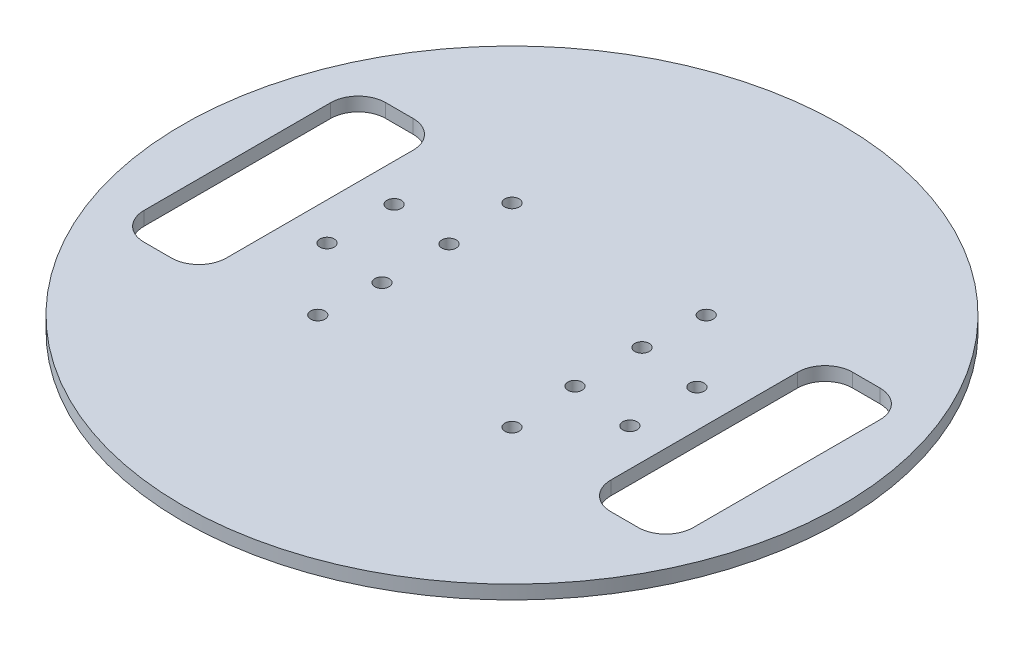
ISO-10303-21;
HEADER;
FILE_DESCRIPTION(('STEP AP214'),'2;1');
FILE_NAME('part.step','',(''),(''),'','','');
FILE_SCHEMA(('AUTOMOTIVE_DESIGN { 1 0 10303 214 1 1 1 1 }'));
ENDSEC;
DATA;
#1=APPLICATION_CONTEXT('core data for automotive mechanical design processes');
#2=APPLICATION_PROTOCOL_DEFINITION('international standard','automotive_design',2000,#1);
#3=PRODUCT_CONTEXT('',#1,'mechanical');
#4=PRODUCT('Part','Part','',(#3));
#5=PRODUCT_RELATED_PRODUCT_CATEGORY('part','',(#4));
#6=PRODUCT_DEFINITION_FORMATION('','',#4);
#7=PRODUCT_DEFINITION_CONTEXT('part definition',#1,'design');
#8=PRODUCT_DEFINITION('design','',#6,#7);
#9=PRODUCT_DEFINITION_SHAPE('','',#8);
#10=(LENGTH_UNIT() NAMED_UNIT(*) SI_UNIT(.MILLI.,.METRE.));
#11=(NAMED_UNIT(*) PLANE_ANGLE_UNIT() SI_UNIT($,.RADIAN.));
#12=(NAMED_UNIT(*) SI_UNIT($,.STERADIAN.) SOLID_ANGLE_UNIT());
#13=UNCERTAINTY_MEASURE_WITH_UNIT(LENGTH_MEASURE(1.E-05),#10,'distance_accuracy_value','');
#14=(GEOMETRIC_REPRESENTATION_CONTEXT(3) GLOBAL_UNCERTAINTY_ASSIGNED_CONTEXT((#13)) GLOBAL_UNIT_ASSIGNED_CONTEXT((#10,
#11,#12)) REPRESENTATION_CONTEXT('',''));
#15=CARTESIAN_POINT('',(0.,0.,0.));
#16=DIRECTION('',(0.,0.,1.));
#17=DIRECTION('',(1.,0.,0.));
#18=AXIS2_PLACEMENT_3D('',#15,#16,#17);
#19=CARTESIAN_POINT('',(-114.3,6.35,43.18));
#20=DIRECTION('',(0.,-1.,0.));
#21=DIRECTION('',(0.,0.,-1.));
#22=AXIS2_PLACEMENT_3D('',#19,#20,#21);
#23=CYLINDRICAL_SURFACE('',#22,12.7);
#24=CARTESIAN_POINT('',(-114.3,0.,43.18));
#25=DIRECTION('',(0.,1.,0.));
#26=DIRECTION('',(0.,0.,1.));
#27=AXIS2_PLACEMENT_3D('',#24,#25,#26);
#28=CIRCLE('',#27,12.7);
#29=CARTESIAN_POINT('',(-127.,0.,43.18));
#30=VERTEX_POINT('',#29);
#31=CARTESIAN_POINT('',(-114.3,0.,55.88));
#32=VERTEX_POINT('',#31);
#33=EDGE_CURVE('E233',#30,#32,#28,.T.);
#34=ORIENTED_EDGE('',*,*,#33,.F.);
#35=DIRECTION('',(0.,-1.,0.));
#36=VECTOR('',#35,1.);
#37=CARTESIAN_POINT('',(-127.,6.35,43.18));
#38=LINE('',#37,#36);
#39=CARTESIAN_POINT('',(-127.,6.35,43.18));
#40=VERTEX_POINT('',#39);
#41=EDGE_CURVE('E11',#40,#30,#38,.T.);
#42=ORIENTED_EDGE('',*,*,#41,.F.);
#43=CARTESIAN_POINT('',(-114.3,6.35,43.18));
#44=DIRECTION('',(0.,1.,0.));
#45=DIRECTION('',(0.,0.,1.));
#46=AXIS2_PLACEMENT_3D('',#43,#44,#45);
#47=CIRCLE('',#46,12.7);
#48=CARTESIAN_POINT('',(-114.3,6.35,55.88));
#49=VERTEX_POINT('',#48);
#50=EDGE_CURVE('E356',#40,#49,#47,.T.);
#51=ORIENTED_EDGE('',*,*,#50,.T.);
#52=DIRECTION('',(0.,-1.,0.));
#53=VECTOR('',#52,1.);
#54=CARTESIAN_POINT('',(-114.3,6.35,55.88));
#55=LINE('',#54,#53);
#56=EDGE_CURVE('E50',#49,#32,#55,.T.);
#57=ORIENTED_EDGE('',*,*,#56,.T.);
#58=EDGE_LOOP('',(#34,#42,#51,#57));
#59=FACE_BOUND('',#58,.T.);
#60=ADVANCED_FACE('F31',(#59),#23,.F.);
#61=CARTESIAN_POINT('',(-127.,6.35,0.));
#62=DIRECTION('',(1.,0.,0.));
#63=DIRECTION('',(0.,0.,-1.));
#64=AXIS2_PLACEMENT_3D('',#61,#62,#63);
#65=PLANE('',#64);
#66=DIRECTION('',(0.,0.,1.));
#67=VECTOR('',#66,1.);
#68=CARTESIAN_POINT('',(-127.,0.,0.));
#69=LINE('',#68,#67);
#70=CARTESIAN_POINT('',(-127.,0.,-43.18));
#71=VERTEX_POINT('',#70);
#72=EDGE_CURVE('E235',#71,#30,#69,.T.);
#73=ORIENTED_EDGE('',*,*,#72,.F.);
#74=DIRECTION('',(0.,-1.,0.));
#75=VECTOR('',#74,1.);
#76=CARTESIAN_POINT('',(-127.,6.35,-43.18));
#77=LINE('',#76,#75);
#78=CARTESIAN_POINT('',(-127.,6.35,-43.18));
#79=VERTEX_POINT('',#78);
#80=EDGE_CURVE('E41',#79,#71,#77,.T.);
#81=ORIENTED_EDGE('',*,*,#80,.F.);
#82=DIRECTION('',(0.,0.,1.));
#83=VECTOR('',#82,1.);
#84=CARTESIAN_POINT('',(-127.,6.35,0.));
#85=LINE('',#84,#83);
#86=EDGE_CURVE('E358',#79,#40,#85,.T.);
#87=ORIENTED_EDGE('',*,*,#86,.T.);
#88=ORIENTED_EDGE('',*,*,#41,.T.);
#89=EDGE_LOOP('',(#73,#81,#87,#88));
#90=FACE_BOUND('',#89,.T.);
#91=ADVANCED_FACE('F389',(#90),#65,.T.);
#92=CARTESIAN_POINT('',(-114.3,6.35,-43.18));
#93=DIRECTION('',(0.,-1.,0.));
#94=DIRECTION('',(0.,0.,-1.));
#95=AXIS2_PLACEMENT_3D('',#92,#93,#94);
#96=CYLINDRICAL_SURFACE('',#95,12.7);
#97=CARTESIAN_POINT('',(-114.3,0.,-43.18));
#98=DIRECTION('',(0.,1.,0.));
#99=DIRECTION('',(0.,0.,1.));
#100=AXIS2_PLACEMENT_3D('',#97,#98,#99);
#101=CIRCLE('',#100,12.7);
#102=CARTESIAN_POINT('',(-114.3,0.,-55.88));
#103=VERTEX_POINT('',#102);
#104=EDGE_CURVE('E238',#103,#71,#101,.T.);
#105=ORIENTED_EDGE('',*,*,#104,.F.);
#106=DIRECTION('',(0.,-1.,0.));
#107=VECTOR('',#106,1.);
#108=CARTESIAN_POINT('',(-114.3,6.35,-55.88));
#109=LINE('',#108,#107);
#110=CARTESIAN_POINT('',(-114.3,6.35,-55.88));
#111=VERTEX_POINT('',#110);
#112=EDGE_CURVE('E274',#111,#103,#109,.T.);
#113=ORIENTED_EDGE('',*,*,#112,.F.);
#114=CARTESIAN_POINT('',(-114.3,6.35,-43.18));
#115=DIRECTION('',(0.,1.,0.));
#116=DIRECTION('',(0.,0.,1.));
#117=AXIS2_PLACEMENT_3D('',#114,#115,#116);
#118=CIRCLE('',#117,12.7);
#119=EDGE_CURVE('E361',#111,#79,#118,.T.);
#120=ORIENTED_EDGE('',*,*,#119,.T.);
#121=ORIENTED_EDGE('',*,*,#80,.T.);
#122=EDGE_LOOP('',(#105,#113,#120,#121));
#123=FACE_BOUND('',#122,.T.);
#124=ADVANCED_FACE('F394',(#123),#96,.F.);
#125=CARTESIAN_POINT('',(-335.421421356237,6.35,-55.88));
#126=DIRECTION('',(0.,0.,1.));
#127=DIRECTION('',(1.,0.,0.));
#128=AXIS2_PLACEMENT_3D('',#125,#126,#127);
#129=PLANE('',#128);
#130=DIRECTION('',(-1.,0.,0.));
#131=VECTOR('',#130,1.);
#132=CARTESIAN_POINT('',(-335.421421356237,0.,-55.88));
#133=LINE('',#132,#131);
#134=CARTESIAN_POINT('',(-101.6,0.,-55.88));
#135=VERTEX_POINT('',#134);
#136=EDGE_CURVE('E241',#135,#103,#133,.T.);
#137=ORIENTED_EDGE('',*,*,#136,.F.);
#138=DIRECTION('',(0.,-1.,0.));
#139=VECTOR('',#138,1.);
#140=CARTESIAN_POINT('',(-101.6,6.35,-55.88));
#141=LINE('',#140,#139);
#142=CARTESIAN_POINT('',(-101.6,6.35,-55.88));
#143=VERTEX_POINT('',#142);
#144=EDGE_CURVE('E272',#143,#135,#141,.T.);
#145=ORIENTED_EDGE('',*,*,#144,.F.);
#146=DIRECTION('',(-1.,0.,0.));
#147=VECTOR('',#146,1.);
#148=CARTESIAN_POINT('',(-335.421421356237,6.35,-55.88));
#149=LINE('',#148,#147);
#150=EDGE_CURVE('E364',#143,#111,#149,.T.);
#151=ORIENTED_EDGE('',*,*,#150,.T.);
#152=ORIENTED_EDGE('',*,*,#112,.T.);
#153=EDGE_LOOP('',(#137,#145,#151,#152));
#154=FACE_BOUND('',#153,.T.);
#155=ADVANCED_FACE('F437',(#154),#129,.T.);
#156=CARTESIAN_POINT('',(-101.6,6.35,-43.18));
#157=DIRECTION('',(0.,-1.,0.));
#158=DIRECTION('',(0.,0.,-1.));
#159=AXIS2_PLACEMENT_3D('',#156,#157,#158);
#160=CYLINDRICAL_SURFACE('',#159,12.7);
#161=CARTESIAN_POINT('',(-101.6,0.,-43.18));
#162=DIRECTION('',(0.,1.,0.));
#163=DIRECTION('',(0.,0.,1.));
#164=AXIS2_PLACEMENT_3D('',#161,#162,#163);
#165=CIRCLE('',#164,12.7);
#166=CARTESIAN_POINT('',(-88.9,0.,-43.18));
#167=VERTEX_POINT('',#166);
#168=EDGE_CURVE('E244',#167,#135,#165,.T.);
#169=ORIENTED_EDGE('',*,*,#168,.F.);
#170=DIRECTION('',(0.,-1.,0.));
#171=VECTOR('',#170,1.);
#172=CARTESIAN_POINT('',(-88.9,6.35,-43.18));
#173=LINE('',#172,#171);
#174=CARTESIAN_POINT('',(-88.9,6.35,-43.18));
#175=VERTEX_POINT('',#174);
#176=EDGE_CURVE('E160',#175,#167,#173,.T.);
#177=ORIENTED_EDGE('',*,*,#176,.F.);
#178=CARTESIAN_POINT('',(-101.6,6.35,-43.18));
#179=DIRECTION('',(0.,1.,0.));
#180=DIRECTION('',(0.,0.,1.));
#181=AXIS2_PLACEMENT_3D('',#178,#179,#180);
#182=CIRCLE('',#181,12.7);
#183=EDGE_CURVE('E172',#175,#143,#182,.T.);
#184=ORIENTED_EDGE('',*,*,#183,.T.);
#185=ORIENTED_EDGE('',*,*,#144,.T.);
#186=EDGE_LOOP('',(#169,#177,#184,#185));
#187=FACE_BOUND('',#186,.T.);
#188=ADVANCED_FACE('F368',(#187),#160,.F.);
#189=CARTESIAN_POINT('',(-88.9,6.35,0.));
#190=DIRECTION('',(-1.,0.,0.));
#191=DIRECTION('',(0.,0.,1.));
#192=AXIS2_PLACEMENT_3D('',#189,#190,#191);
#193=PLANE('',#192);
#194=DIRECTION('',(0.,0.,-1.));
#195=VECTOR('',#194,1.);
#196=CARTESIAN_POINT('',(-88.9,0.,0.));
#197=LINE('',#196,#195);
#198=CARTESIAN_POINT('',(-88.9,0.,43.18));
#199=VERTEX_POINT('',#198);
#200=EDGE_CURVE('E156',#199,#167,#197,.T.);
#201=ORIENTED_EDGE('',*,*,#200,.F.);
#202=DIRECTION('',(0.,-1.,0.));
#203=VECTOR('',#202,1.);
#204=CARTESIAN_POINT('',(-88.9,6.35,43.18));
#205=LINE('',#204,#203);
#206=CARTESIAN_POINT('',(-88.9,6.35,43.18));
#207=VERTEX_POINT('',#206);
#208=EDGE_CURVE('E151',#207,#199,#205,.T.);
#209=ORIENTED_EDGE('',*,*,#208,.F.);
#210=DIRECTION('',(0.,0.,-1.));
#211=VECTOR('',#210,1.);
#212=CARTESIAN_POINT('',(-88.9,6.35,0.));
#213=LINE('',#212,#211);
#214=EDGE_CURVE('E154',#207,#175,#213,.T.);
#215=ORIENTED_EDGE('',*,*,#214,.T.);
#216=ORIENTED_EDGE('',*,*,#176,.T.);
#217=EDGE_LOOP('',(#201,#209,#215,#216));
#218=FACE_BOUND('',#217,.T.);
#219=ADVANCED_FACE('F153',(#218),#193,.T.);
#220=CARTESIAN_POINT('',(-101.6,6.35,43.18));
#221=DIRECTION('',(0.,-1.,0.));
#222=DIRECTION('',(0.,0.,-1.));
#223=AXIS2_PLACEMENT_3D('',#220,#221,#222);
#224=CYLINDRICAL_SURFACE('',#223,12.7);
#225=CARTESIAN_POINT('',(-101.6,0.,43.18));
#226=DIRECTION('',(0.,1.,0.));
#227=DIRECTION('',(0.,0.,1.));
#228=AXIS2_PLACEMENT_3D('',#225,#226,#227);
#229=CIRCLE('',#228,12.7);
#230=CARTESIAN_POINT('',(-101.6,0.,55.88));
#231=VERTEX_POINT('',#230);
#232=EDGE_CURVE('E248',#231,#199,#229,.T.);
#233=ORIENTED_EDGE('',*,*,#232,.F.);
#234=DIRECTION('',(0.,-1.,0.));
#235=VECTOR('',#234,1.);
#236=CARTESIAN_POINT('',(-101.6,6.35,55.88));
#237=LINE('',#236,#235);
#238=CARTESIAN_POINT('',(-101.6,6.35,55.88));
#239=VERTEX_POINT('',#238);
#240=EDGE_CURVE('E99',#239,#231,#237,.T.);
#241=ORIENTED_EDGE('',*,*,#240,.F.);
#242=CARTESIAN_POINT('',(-101.6,6.35,43.18));
#243=DIRECTION('',(0.,1.,0.));
#244=DIRECTION('',(0.,0.,1.));
#245=AXIS2_PLACEMENT_3D('',#242,#243,#244);
#246=CIRCLE('',#245,12.7);
#247=EDGE_CURVE('E169',#239,#207,#246,.T.);
#248=ORIENTED_EDGE('',*,*,#247,.T.);
#249=ORIENTED_EDGE('',*,*,#208,.T.);
#250=EDGE_LOOP('',(#233,#241,#248,#249));
#251=FACE_BOUND('',#250,.T.);
#252=ADVANCED_FACE('F174',(#251),#224,.F.);
#253=CARTESIAN_POINT('',(101.6,6.35,43.18));
#254=DIRECTION('',(0.,-1.,0.));
#255=DIRECTION('',(0.,0.,-1.));
#256=AXIS2_PLACEMENT_3D('',#253,#254,#255);
#257=CYLINDRICAL_SURFACE('',#256,12.7);
#258=CARTESIAN_POINT('',(101.6,0.,43.18));
#259=DIRECTION('',(0.,1.,0.));
#260=DIRECTION('',(0.,0.,1.));
#261=AXIS2_PLACEMENT_3D('',#258,#259,#260);
#262=CIRCLE('',#261,12.7);
#263=CARTESIAN_POINT('',(88.9,0.,43.18));
#264=VERTEX_POINT('',#263);
#265=CARTESIAN_POINT('',(101.6,0.,55.88));
#266=VERTEX_POINT('',#265);
#267=EDGE_CURVE('E196',#264,#266,#262,.T.);
#268=ORIENTED_EDGE('',*,*,#267,.F.);
#269=DIRECTION('',(0.,-1.,0.));
#270=VECTOR('',#269,1.);
#271=CARTESIAN_POINT('',(88.9,6.35,43.18));
#272=LINE('',#271,#270);
#273=CARTESIAN_POINT('',(88.9,6.35,43.18));
#274=VERTEX_POINT('',#273);
#275=EDGE_CURVE('E35',#274,#264,#272,.T.);
#276=ORIENTED_EDGE('',*,*,#275,.F.);
#277=CARTESIAN_POINT('',(101.6,6.35,43.18));
#278=DIRECTION('',(0.,1.,0.));
#279=DIRECTION('',(0.,0.,1.));
#280=AXIS2_PLACEMENT_3D('',#277,#278,#279);
#281=CIRCLE('',#280,12.7);
#282=CARTESIAN_POINT('',(101.6,6.35,55.88));
#283=VERTEX_POINT('',#282);
#284=EDGE_CURVE('E268',#274,#283,#281,.T.);
#285=ORIENTED_EDGE('',*,*,#284,.T.);
#286=DIRECTION('',(0.,-1.,0.));
#287=VECTOR('',#286,1.);
#288=CARTESIAN_POINT('',(101.6,6.35,55.88));
#289=LINE('',#288,#287);
#290=EDGE_CURVE('E195',#283,#266,#289,.T.);
#291=ORIENTED_EDGE('',*,*,#290,.T.);
#292=EDGE_LOOP('',(#268,#276,#285,#291));
#293=FACE_BOUND('',#292,.T.);
#294=ADVANCED_FACE('F33',(#293),#257,.F.);
#295=CARTESIAN_POINT('',(88.9,6.35,0.));
#296=DIRECTION('',(-1.,0.,0.));
#297=DIRECTION('',(0.,0.,1.));
#298=AXIS2_PLACEMENT_3D('',#295,#296,#297);
#299=PLANE('',#298);
#300=DIRECTION('',(0.,0.,-1.));
#301=VECTOR('',#300,1.);
#302=CARTESIAN_POINT('',(88.9,0.,0.));
#303=LINE('',#302,#301);
#304=CARTESIAN_POINT('',(88.9,0.,-43.18));
#305=VERTEX_POINT('',#304);
#306=EDGE_CURVE('E199',#264,#305,#303,.T.);
#307=ORIENTED_EDGE('',*,*,#306,.T.);
#308=DIRECTION('',(0.,-1.,0.));
#309=VECTOR('',#308,1.);
#310=CARTESIAN_POINT('',(88.9,6.35,-43.18));
#311=LINE('',#310,#309);
#312=CARTESIAN_POINT('',(88.9,6.35,-43.18));
#313=VERTEX_POINT('',#312);
#314=EDGE_CURVE('E287',#313,#305,#311,.T.);
#315=ORIENTED_EDGE('',*,*,#314,.F.);
#316=DIRECTION('',(0.,0.,-1.));
#317=VECTOR('',#316,1.);
#318=CARTESIAN_POINT('',(88.9,6.35,0.));
#319=LINE('',#318,#317);
#320=EDGE_CURVE('E295',#274,#313,#319,.T.);
#321=ORIENTED_EDGE('',*,*,#320,.F.);
#322=ORIENTED_EDGE('',*,*,#275,.T.);
#323=EDGE_LOOP('',(#307,#315,#321,#322));
#324=FACE_BOUND('',#323,.T.);
#325=ADVANCED_FACE('F294',(#324),#299,.F.);
#326=CARTESIAN_POINT('',(101.6,6.35,-43.18));
#327=DIRECTION('',(0.,-1.,0.));
#328=DIRECTION('',(0.,0.,-1.));
#329=AXIS2_PLACEMENT_3D('',#326,#327,#328);
#330=CYLINDRICAL_SURFACE('',#329,12.7);
#331=CARTESIAN_POINT('',(101.6,0.,-43.18));
#332=DIRECTION('',(0.,1.,0.));
#333=DIRECTION('',(0.,0.,1.));
#334=AXIS2_PLACEMENT_3D('',#331,#332,#333);
#335=CIRCLE('',#334,12.7);
#336=CARTESIAN_POINT('',(101.6,0.,-55.88));
#337=VERTEX_POINT('',#336);
#338=EDGE_CURVE('E203',#337,#305,#335,.T.);
#339=ORIENTED_EDGE('',*,*,#338,.F.);
#340=DIRECTION('',(0.,-1.,0.));
#341=VECTOR('',#340,1.);
#342=CARTESIAN_POINT('',(101.6,6.35,-55.88));
#343=LINE('',#342,#341);
#344=CARTESIAN_POINT('',(101.6,6.35,-55.88));
#345=VERTEX_POINT('',#344);
#346=EDGE_CURVE('E286',#345,#337,#343,.T.);
#347=ORIENTED_EDGE('',*,*,#346,.F.);
#348=CARTESIAN_POINT('',(101.6,6.35,-43.18));
#349=DIRECTION('',(0.,1.,0.));
#350=DIRECTION('',(0.,0.,1.));
#351=AXIS2_PLACEMENT_3D('',#348,#349,#350);
#352=CIRCLE('',#351,12.7);
#353=EDGE_CURVE('E329',#345,#313,#352,.T.);
#354=ORIENTED_EDGE('',*,*,#353,.T.);
#355=ORIENTED_EDGE('',*,*,#314,.T.);
#356=EDGE_LOOP('',(#339,#347,#354,#355));
#357=FACE_BOUND('',#356,.T.);
#358=ADVANCED_FACE('F327',(#357),#330,.F.);
#359=CARTESIAN_POINT('',(-335.421421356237,6.35,-55.88));
#360=DIRECTION('',(0.,0.,-1.));
#361=DIRECTION('',(-1.,0.,0.));
#362=AXIS2_PLACEMENT_3D('',#359,#360,#361);
#363=PLANE('',#362);
#364=DIRECTION('',(1.,0.,0.));
#365=VECTOR('',#364,1.);
#366=CARTESIAN_POINT('',(-335.421421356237,0.,-55.88));
#367=LINE('',#366,#365);
#368=CARTESIAN_POINT('',(114.3,0.,-55.88));
#369=VERTEX_POINT('',#368);
#370=EDGE_CURVE('E206',#337,#369,#367,.T.);
#371=ORIENTED_EDGE('',*,*,#370,.T.);
#372=DIRECTION('',(0.,-1.,0.));
#373=VECTOR('',#372,1.);
#374=CARTESIAN_POINT('',(114.3,6.35,-55.88));
#375=LINE('',#374,#373);
#376=CARTESIAN_POINT('',(114.3,6.35,-55.88));
#377=VERTEX_POINT('',#376);
#378=EDGE_CURVE('E284',#377,#369,#375,.T.);
#379=ORIENTED_EDGE('',*,*,#378,.F.);
#380=DIRECTION('',(1.,0.,0.));
#381=VECTOR('',#380,1.);
#382=CARTESIAN_POINT('',(-335.421421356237,6.35,-55.88));
#383=LINE('',#382,#381);
#384=EDGE_CURVE('E330',#345,#377,#383,.T.);
#385=ORIENTED_EDGE('',*,*,#384,.F.);
#386=ORIENTED_EDGE('',*,*,#346,.T.);
#387=EDGE_LOOP('',(#371,#379,#385,#386));
#388=FACE_BOUND('',#387,.T.);
#389=ADVANCED_FACE('F326',(#388),#363,.F.);
#390=CARTESIAN_POINT('',(114.3,6.35,-43.18));
#391=DIRECTION('',(0.,-1.,0.));
#392=DIRECTION('',(0.,0.,-1.));
#393=AXIS2_PLACEMENT_3D('',#390,#391,#392);
#394=CYLINDRICAL_SURFACE('',#393,12.7);
#395=CARTESIAN_POINT('',(114.3,0.,-43.18));
#396=DIRECTION('',(0.,1.,0.));
#397=DIRECTION('',(0.,0.,1.));
#398=AXIS2_PLACEMENT_3D('',#395,#396,#397);
#399=CIRCLE('',#398,12.7);
#400=CARTESIAN_POINT('',(127.,0.,-43.18));
#401=VERTEX_POINT('',#400);
#402=EDGE_CURVE('E209',#401,#369,#399,.T.);
#403=ORIENTED_EDGE('',*,*,#402,.F.);
#404=DIRECTION('',(0.,-1.,0.));
#405=VECTOR('',#404,1.);
#406=CARTESIAN_POINT('',(127.,6.35,-43.18));
#407=LINE('',#406,#405);
#408=CARTESIAN_POINT('',(127.,6.35,-43.18));
#409=VERTEX_POINT('',#408);
#410=EDGE_CURVE('E282',#409,#401,#407,.T.);
#411=ORIENTED_EDGE('',*,*,#410,.F.);
#412=CARTESIAN_POINT('',(114.3,6.35,-43.18));
#413=DIRECTION('',(0.,1.,0.));
#414=DIRECTION('',(0.,0.,1.));
#415=AXIS2_PLACEMENT_3D('',#412,#413,#414);
#416=CIRCLE('',#415,12.7);
#417=EDGE_CURVE('E323',#409,#377,#416,.T.);
#418=ORIENTED_EDGE('',*,*,#417,.T.);
#419=ORIENTED_EDGE('',*,*,#378,.T.);
#420=EDGE_LOOP('',(#403,#411,#418,#419));
#421=FACE_BOUND('',#420,.T.);
#422=ADVANCED_FACE('F319',(#421),#394,.F.);
#423=CARTESIAN_POINT('',(127.,6.35,0.));
#424=DIRECTION('',(1.,0.,0.));
#425=DIRECTION('',(0.,0.,-1.));
#426=AXIS2_PLACEMENT_3D('',#423,#424,#425);
#427=PLANE('',#426);
#428=DIRECTION('',(0.,0.,1.));
#429=VECTOR('',#428,1.);
#430=CARTESIAN_POINT('',(127.,0.,0.));
#431=LINE('',#430,#429);
#432=CARTESIAN_POINT('',(127.,0.,43.18));
#433=VERTEX_POINT('',#432);
#434=EDGE_CURVE('E212',#401,#433,#431,.T.);
#435=ORIENTED_EDGE('',*,*,#434,.T.);
#436=DIRECTION('',(0.,-1.,0.));
#437=VECTOR('',#436,1.);
#438=CARTESIAN_POINT('',(127.,6.35,43.18));
#439=LINE('',#438,#437);
#440=CARTESIAN_POINT('',(127.,6.35,43.18));
#441=VERTEX_POINT('',#440);
#442=EDGE_CURVE('E280',#441,#433,#439,.T.);
#443=ORIENTED_EDGE('',*,*,#442,.F.);
#444=DIRECTION('',(0.,0.,1.));
#445=VECTOR('',#444,1.);
#446=CARTESIAN_POINT('',(127.,6.35,0.));
#447=LINE('',#446,#445);
#448=EDGE_CURVE('E339',#409,#441,#447,.T.);
#449=ORIENTED_EDGE('',*,*,#448,.F.);
#450=ORIENTED_EDGE('',*,*,#410,.T.);
#451=EDGE_LOOP('',(#435,#443,#449,#450));
#452=FACE_BOUND('',#451,.T.);
#453=ADVANCED_FACE('F316',(#452),#427,.F.);
#454=CARTESIAN_POINT('',(114.3,6.35,43.18));
#455=DIRECTION('',(0.,-1.,0.));
#456=DIRECTION('',(0.,0.,-1.));
#457=AXIS2_PLACEMENT_3D('',#454,#455,#456);
#458=CYLINDRICAL_SURFACE('',#457,12.7);
#459=CARTESIAN_POINT('',(114.3,0.,43.18));
#460=DIRECTION('',(0.,1.,0.));
#461=DIRECTION('',(0.,0.,1.));
#462=AXIS2_PLACEMENT_3D('',#459,#460,#461);
#463=CIRCLE('',#462,12.7);
#464=CARTESIAN_POINT('',(114.3,0.,55.88));
#465=VERTEX_POINT('',#464);
#466=EDGE_CURVE('E215',#465,#433,#463,.T.);
#467=ORIENTED_EDGE('',*,*,#466,.F.);
#468=DIRECTION('',(0.,-1.,0.));
#469=VECTOR('',#468,1.);
#470=CARTESIAN_POINT('',(114.3,6.35,55.88));
#471=LINE('',#470,#469);
#472=CARTESIAN_POINT('',(114.3,6.35,55.88));
#473=VERTEX_POINT('',#472);
#474=EDGE_CURVE('E278',#473,#465,#471,.T.);
#475=ORIENTED_EDGE('',*,*,#474,.F.);
#476=CARTESIAN_POINT('',(114.3,6.35,43.18));
#477=DIRECTION('',(0.,1.,0.));
#478=DIRECTION('',(0.,0.,1.));
#479=AXIS2_PLACEMENT_3D('',#476,#477,#478);
#480=CIRCLE('',#479,12.7);
#481=EDGE_CURVE('E313',#473,#441,#480,.T.);
#482=ORIENTED_EDGE('',*,*,#481,.T.);
#483=ORIENTED_EDGE('',*,*,#442,.T.);
#484=EDGE_LOOP('',(#467,#475,#482,#483));
#485=FACE_BOUND('',#484,.T.);
#486=ADVANCED_FACE('F309',(#485),#458,.F.);
#487=CARTESIAN_POINT('',(-43.03131856,6.35,-13.91245376));
#488=DIRECTION('',(0.,-1.,0.));
#489=DIRECTION('',(0.,0.,-1.));
#490=AXIS2_PLACEMENT_3D('',#487,#488,#489);
#491=CYLINDRICAL_SURFACE('',#490,3.302);
#492=CARTESIAN_POINT('',(-43.03131856,6.35,-13.91245376));
#493=DIRECTION('',(0.,1.,0.));
#494=DIRECTION('',(0.,0.,1.));
#495=AXIS2_PLACEMENT_3D('',#492,#493,#494);
#496=CIRCLE('',#495,3.302);
#497=CARTESIAN_POINT('',(-43.03131856,6.35,-10.61045376));
#498=VERTEX_POINT('',#497);
#499=EDGE_CURVE('E189',#498,#498,#496,.T.);
#500=ORIENTED_EDGE('',*,*,#499,.T.);
#501=EDGE_LOOP('',(#500));
#502=FACE_BOUND('',#501,.T.);
#503=CARTESIAN_POINT('',(-43.03131856,0.,-13.91245376));
#504=DIRECTION('',(0.,1.,0.));
#505=DIRECTION('',(0.,0.,1.));
#506=AXIS2_PLACEMENT_3D('',#503,#504,#505);
#507=CIRCLE('',#506,3.302);
#508=CARTESIAN_POINT('',(-43.03131856,0.,-10.61045376));
#509=VERTEX_POINT('',#508);
#510=EDGE_CURVE('E262',#509,#509,#507,.T.);
#511=ORIENTED_EDGE('',*,*,#510,.F.);
#512=EDGE_LOOP('',(#511));
#513=FACE_BOUND('',#512,.T.);
#514=ADVANCED_FACE('F415',(#502,#513),#491,.F.);
#515=CARTESIAN_POINT('',(-43.03131856,6.35,17.08745376));
#516=DIRECTION('',(0.,-1.,0.));
#517=DIRECTION('',(0.,0.,-1.));
#518=AXIS2_PLACEMENT_3D('',#515,#516,#517);
#519=CYLINDRICAL_SURFACE('',#518,3.302);
#520=CARTESIAN_POINT('',(-43.03131856,6.35,17.08745376));
#521=DIRECTION('',(0.,1.,0.));
#522=DIRECTION('',(0.,0.,1.));
#523=AXIS2_PLACEMENT_3D('',#520,#521,#522);
#524=CIRCLE('',#523,3.302);
#525=CARTESIAN_POINT('',(-43.03131856,6.35,20.38945376));
#526=VERTEX_POINT('',#525);
#527=EDGE_CURVE('E186',#526,#526,#524,.T.);
#528=ORIENTED_EDGE('',*,*,#527,.T.);
#529=EDGE_LOOP('',(#528));
#530=FACE_BOUND('',#529,.T.);
#531=CARTESIAN_POINT('',(-43.03131856,0.,17.08745376));
#532=DIRECTION('',(0.,1.,0.));
#533=DIRECTION('',(0.,0.,1.));
#534=AXIS2_PLACEMENT_3D('',#531,#532,#533);
#535=CIRCLE('',#534,3.302);
#536=CARTESIAN_POINT('',(-43.03131856,0.,20.38945376));
#537=VERTEX_POINT('',#536);
#538=EDGE_CURVE('E259',#537,#537,#535,.T.);
#539=ORIENTED_EDGE('',*,*,#538,.F.);
#540=EDGE_LOOP('',(#539));
#541=FACE_BOUND('',#540,.T.);
#542=ADVANCED_FACE('F513',(#530,#541),#519,.F.);
#543=CARTESIAN_POINT('',(-71.60631856,6.35,-17.08745376));
#544=DIRECTION('',(0.,-1.,0.));
#545=DIRECTION('',(0.,0.,-1.));
#546=AXIS2_PLACEMENT_3D('',#543,#544,#545);
#547=CYLINDRICAL_SURFACE('',#546,3.302);
#548=CARTESIAN_POINT('',(-71.60631856,6.35,-17.08745376));
#549=DIRECTION('',(0.,1.,0.));
#550=DIRECTION('',(0.,0.,1.));
#551=AXIS2_PLACEMENT_3D('',#548,#549,#550);
#552=CIRCLE('',#551,3.302);
#553=CARTESIAN_POINT('',(-71.60631856,6.35,-13.78545376));
#554=VERTEX_POINT('',#553);
#555=EDGE_CURVE('E183',#554,#554,#552,.T.);
#556=ORIENTED_EDGE('',*,*,#555,.T.);
#557=EDGE_LOOP('',(#556));
#558=FACE_BOUND('',#557,.T.);
#559=CARTESIAN_POINT('',(-71.60631856,0.,-17.08745376));
#560=DIRECTION('',(0.,1.,0.));
#561=DIRECTION('',(0.,0.,1.));
#562=AXIS2_PLACEMENT_3D('',#559,#560,#561);
#563=CIRCLE('',#562,3.302);
#564=CARTESIAN_POINT('',(-71.60631856,0.,-13.78545376));
#565=VERTEX_POINT('',#564);
#566=EDGE_CURVE('E256',#565,#565,#563,.T.);
#567=ORIENTED_EDGE('',*,*,#566,.F.);
#568=EDGE_LOOP('',(#567));
#569=FACE_BOUND('',#568,.T.);
#570=ADVANCED_FACE('F384',(#558,#569),#547,.F.);
#571=CARTESIAN_POINT('',(-71.60631856,6.35,13.91245376));
#572=DIRECTION('',(0.,-1.,0.));
#573=DIRECTION('',(0.,0.,-1.));
#574=AXIS2_PLACEMENT_3D('',#571,#572,#573);
#575=CYLINDRICAL_SURFACE('',#574,3.302);
#576=CARTESIAN_POINT('',(-71.60631856,6.35,13.91245376));
#577=DIRECTION('',(0.,1.,0.));
#578=DIRECTION('',(0.,0.,1.));
#579=AXIS2_PLACEMENT_3D('',#576,#577,#578);
#580=CIRCLE('',#579,3.302);
#581=CARTESIAN_POINT('',(-71.60631856,6.35,17.21445376));
#582=VERTEX_POINT('',#581);
#583=EDGE_CURVE('E177',#582,#582,#580,.T.);
#584=ORIENTED_EDGE('',*,*,#583,.T.);
#585=EDGE_LOOP('',(#584));
#586=FACE_BOUND('',#585,.T.);
#587=CARTESIAN_POINT('',(-71.60631856,0.,13.91245376));
#588=DIRECTION('',(0.,1.,0.));
#589=DIRECTION('',(0.,0.,1.));
#590=AXIS2_PLACEMENT_3D('',#587,#588,#589);
#591=CIRCLE('',#590,3.302);
#592=CARTESIAN_POINT('',(-71.60631856,0.,17.21445376));
#593=VERTEX_POINT('',#592);
#594=EDGE_CURVE('E253',#593,#593,#591,.T.);
#595=ORIENTED_EDGE('',*,*,#594,.F.);
#596=EDGE_LOOP('',(#595));
#597=FACE_BOUND('',#596,.T.);
#598=ADVANCED_FACE('F375',(#586,#597),#575,.F.);
#599=CARTESIAN_POINT('',(-335.421421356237,6.35,55.88));
#600=DIRECTION('',(0.,0.,-1.));
#601=DIRECTION('',(-1.,0.,0.));
#602=AXIS2_PLACEMENT_3D('',#599,#600,#601);
#603=PLANE('',#602);
#604=DIRECTION('',(1.,0.,0.));
#605=VECTOR('',#604,1.);
#606=CARTESIAN_POINT('',(-335.421421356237,0.,55.88));
#607=LINE('',#606,#605);
#608=EDGE_CURVE('E250',#32,#231,#607,.T.);
#609=ORIENTED_EDGE('',*,*,#608,.F.);
#610=ORIENTED_EDGE('',*,*,#56,.F.);
#611=DIRECTION('',(1.,0.,0.));
#612=VECTOR('',#611,1.);
#613=CARTESIAN_POINT('',(-335.421421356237,6.35,55.88));
#614=LINE('',#613,#612);
#615=EDGE_CURVE('E175',#49,#239,#614,.T.);
#616=ORIENTED_EDGE('',*,*,#615,.T.);
#617=ORIENTED_EDGE('',*,*,#240,.T.);
#618=EDGE_LOOP('',(#609,#610,#616,#617));
#619=FACE_BOUND('',#618,.T.);
#620=ADVANCED_FACE('F372',(#619),#603,.T.);
#621=CARTESIAN_POINT('',(43.03131856,6.35,13.91245376));
#622=DIRECTION('',(0.,-1.,0.));
#623=DIRECTION('',(0.,0.,-1.));
#624=AXIS2_PLACEMENT_3D('',#621,#622,#623);
#625=CYLINDRICAL_SURFACE('',#624,3.302);
#626=CARTESIAN_POINT('',(43.03131856,6.35,13.91245376));
#627=DIRECTION('',(0.,1.,0.));
#628=DIRECTION('',(0.,0.,1.));
#629=AXIS2_PLACEMENT_3D('',#626,#627,#628);
#630=CIRCLE('',#629,3.302);
#631=CARTESIAN_POINT('',(43.03131856,6.35,17.21445376));
#632=VERTEX_POINT('',#631);
#633=EDGE_CURVE('E353',#632,#632,#630,.T.);
#634=ORIENTED_EDGE('',*,*,#633,.T.);
#635=EDGE_LOOP('',(#634));
#636=FACE_BOUND('',#635,.T.);
#637=CARTESIAN_POINT('',(43.03131856,0.,13.91245376));
#638=DIRECTION('',(0.,1.,0.));
#639=DIRECTION('',(0.,0.,1.));
#640=AXIS2_PLACEMENT_3D('',#637,#638,#639);
#641=CIRCLE('',#640,3.302);
#642=CARTESIAN_POINT('',(43.03131856,0.,17.21445376));
#643=VERTEX_POINT('',#642);
#644=EDGE_CURVE('E230',#643,#643,#641,.T.);
#645=ORIENTED_EDGE('',*,*,#644,.F.);
#646=EDGE_LOOP('',(#645));
#647=FACE_BOUND('',#646,.T.);
#648=ADVANCED_FACE('F374',(#636,#647),#625,.F.);
#649=CARTESIAN_POINT('',(43.03131856,6.35,-17.08745376));
#650=DIRECTION('',(0.,-1.,0.));
#651=DIRECTION('',(0.,0.,-1.));
#652=AXIS2_PLACEMENT_3D('',#649,#650,#651);
#653=CYLINDRICAL_SURFACE('',#652,3.302);
#654=CARTESIAN_POINT('',(43.03131856,6.35,-17.08745376));
#655=DIRECTION('',(0.,1.,0.));
#656=DIRECTION('',(0.,0.,1.));
#657=AXIS2_PLACEMENT_3D('',#654,#655,#656);
#658=CIRCLE('',#657,3.302);
#659=CARTESIAN_POINT('',(43.03131856,6.35,-13.78545376));
#660=VERTEX_POINT('',#659);
#661=EDGE_CURVE('E350',#660,#660,#658,.T.);
#662=ORIENTED_EDGE('',*,*,#661,.T.);
#663=EDGE_LOOP('',(#662));
#664=FACE_BOUND('',#663,.T.);
#665=CARTESIAN_POINT('',(43.03131856,0.,-17.08745376));
#666=DIRECTION('',(0.,1.,0.));
#667=DIRECTION('',(0.,0.,1.));
#668=AXIS2_PLACEMENT_3D('',#665,#666,#667);
#669=CIRCLE('',#668,3.302);
#670=CARTESIAN_POINT('',(43.03131856,0.,-13.78545376));
#671=VERTEX_POINT('',#670);
#672=EDGE_CURVE('E227',#671,#671,#669,.T.);
#673=ORIENTED_EDGE('',*,*,#672,.F.);
#674=EDGE_LOOP('',(#673));
#675=FACE_BOUND('',#674,.T.);
#676=ADVANCED_FACE('F381',(#664,#675),#653,.F.);
#677=CARTESIAN_POINT('',(71.60631856,6.35,17.08745376));
#678=DIRECTION('',(0.,-1.,0.));
#679=DIRECTION('',(0.,0.,-1.));
#680=AXIS2_PLACEMENT_3D('',#677,#678,#679);
#681=CYLINDRICAL_SURFACE('',#680,3.302);
#682=CARTESIAN_POINT('',(71.60631856,6.35,17.08745376));
#683=DIRECTION('',(0.,1.,0.));
#684=DIRECTION('',(0.,0.,1.));
#685=AXIS2_PLACEMENT_3D('',#682,#683,#684);
#686=CIRCLE('',#685,3.302);
#687=CARTESIAN_POINT('',(71.60631856,6.35,20.38945376));
#688=VERTEX_POINT('',#687);
#689=EDGE_CURVE('E347',#688,#688,#686,.T.);
#690=ORIENTED_EDGE('',*,*,#689,.T.);
#691=EDGE_LOOP('',(#690));
#692=FACE_BOUND('',#691,.T.);
#693=CARTESIAN_POINT('',(71.60631856,0.,17.08745376));
#694=DIRECTION('',(0.,1.,0.));
#695=DIRECTION('',(0.,0.,1.));
#696=AXIS2_PLACEMENT_3D('',#693,#694,#695);
#697=CIRCLE('',#696,3.302);
#698=CARTESIAN_POINT('',(71.60631856,0.,20.38945376));
#699=VERTEX_POINT('',#698);
#700=EDGE_CURVE('E224',#699,#699,#697,.T.);
#701=ORIENTED_EDGE('',*,*,#700,.F.);
#702=EDGE_LOOP('',(#701));
#703=FACE_BOUND('',#702,.T.);
#704=ADVANCED_FACE('F401',(#692,#703),#681,.F.);
#705=CARTESIAN_POINT('',(71.60631856,6.35,-13.91245376));
#706=DIRECTION('',(0.,-1.,0.));
#707=DIRECTION('',(0.,0.,-1.));
#708=AXIS2_PLACEMENT_3D('',#705,#706,#707);
#709=CYLINDRICAL_SURFACE('',#708,3.302);
#710=CARTESIAN_POINT('',(71.60631856,6.35,-13.91245376));
#711=DIRECTION('',(0.,1.,0.));
#712=DIRECTION('',(0.,0.,1.));
#713=AXIS2_PLACEMENT_3D('',#710,#711,#712);
#714=CIRCLE('',#713,3.302);
#715=CARTESIAN_POINT('',(71.60631856,6.35,-10.61045376));
#716=VERTEX_POINT('',#715);
#717=EDGE_CURVE('E344',#716,#716,#714,.T.);
#718=ORIENTED_EDGE('',*,*,#717,.T.);
#719=EDGE_LOOP('',(#718));
#720=FACE_BOUND('',#719,.T.);
#721=CARTESIAN_POINT('',(71.60631856,0.,-13.91245376));
#722=DIRECTION('',(0.,1.,0.));
#723=DIRECTION('',(0.,0.,1.));
#724=AXIS2_PLACEMENT_3D('',#721,#722,#723);
#725=CIRCLE('',#724,3.302);
#726=CARTESIAN_POINT('',(71.60631856,0.,-10.61045376));
#727=VERTEX_POINT('',#726);
#728=EDGE_CURVE('E221',#727,#727,#725,.T.);
#729=ORIENTED_EDGE('',*,*,#728,.F.);
#730=EDGE_LOOP('',(#729));
#731=FACE_BOUND('',#730,.T.);
#732=ADVANCED_FACE('F405',(#720,#731),#709,.F.);
#733=CARTESIAN_POINT('',(-335.421421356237,6.35,55.88));
#734=DIRECTION('',(0.,0.,1.));
#735=DIRECTION('',(1.,0.,0.));
#736=AXIS2_PLACEMENT_3D('',#733,#734,#735);
#737=PLANE('',#736);
#738=DIRECTION('',(-1.,0.,0.));
#739=VECTOR('',#738,1.);
#740=CARTESIAN_POINT('',(-335.421421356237,0.,55.88));
#741=LINE('',#740,#739);
#742=EDGE_CURVE('E218',#465,#266,#741,.T.);
#743=ORIENTED_EDGE('',*,*,#742,.T.);
#744=ORIENTED_EDGE('',*,*,#290,.F.);
#745=DIRECTION('',(-1.,0.,0.));
#746=VECTOR('',#745,1.);
#747=CARTESIAN_POINT('',(-335.421421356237,6.35,55.88));
#748=LINE('',#747,#746);
#749=EDGE_CURVE('E342',#473,#283,#748,.T.);
#750=ORIENTED_EDGE('',*,*,#749,.F.);
#751=ORIENTED_EDGE('',*,*,#474,.T.);
#752=EDGE_LOOP('',(#743,#744,#750,#751));
#753=FACE_BOUND('',#752,.T.);
#754=ADVANCED_FACE('F305',(#753),#737,.F.);
#755=CARTESIAN_POINT('',(0.,6.35,0.));
#756=DIRECTION('',(0.,-1.,0.));
#757=DIRECTION('',(0.,0.,-1.));
#758=AXIS2_PLACEMENT_3D('',#755,#756,#757);
#759=CYLINDRICAL_SURFACE('',#758,152.4);
#760=CARTESIAN_POINT('',(0.,6.35,0.));
#761=DIRECTION('',(0.,1.,0.));
#762=DIRECTION('',(0.,0.,1.));
#763=AXIS2_PLACEMENT_3D('',#760,#761,#762);
#764=CIRCLE('',#763,152.4);
#765=CARTESIAN_POINT('',(0.,6.35,152.4));
#766=VERTEX_POINT('',#765);
#767=EDGE_CURVE('E192',#766,#766,#764,.T.);
#768=ORIENTED_EDGE('',*,*,#767,.F.);
#769=EDGE_LOOP('',(#768));
#770=FACE_BOUND('',#769,.T.);
#771=CARTESIAN_POINT('',(0.,0.,0.));
#772=DIRECTION('',(0.,1.,0.));
#773=DIRECTION('',(0.,0.,1.));
#774=AXIS2_PLACEMENT_3D('',#771,#772,#773);
#775=CIRCLE('',#774,152.4);
#776=CARTESIAN_POINT('',(0.,0.,152.4));
#777=VERTEX_POINT('',#776);
#778=EDGE_CURVE('E265',#777,#777,#775,.T.);
#779=ORIENTED_EDGE('',*,*,#778,.T.);
#780=EDGE_LOOP('',(#779));
#781=FACE_BOUND('',#780,.T.);
#782=ADVANCED_FACE('F412',(#770,#781),#759,.T.);
#783=CARTESIAN_POINT('',(-335.421421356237,6.35,0.));
#784=DIRECTION('',(0.,1.,0.));
#785=DIRECTION('',(0.,0.,1.));
#786=AXIS2_PLACEMENT_3D('',#783,#784,#785);
#787=PLANE('',#786);
#788=CARTESIAN_POINT('',(44.9012806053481,6.35,44.9012806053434));
#789=DIRECTION('',(0.,1.,0.));
#790=DIRECTION('',(1.,0.,0.));
#791=AXIS2_PLACEMENT_3D('',#788,#789,#790);
#792=CIRCLE('',#791,3.30200000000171);
#793=CARTESIAN_POINT('',(48.2032806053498,6.35,44.9012806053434));
#794=VERTEX_POINT('',#793);
#795=EDGE_CURVE('E649',#794,#794,#792,.T.);
#796=ORIENTED_EDGE('',*,*,#795,.F.);
#797=EDGE_LOOP('',(#796));
#798=FACE_BOUND('',#797,.T.);
#799=CARTESIAN_POINT('',(44.9012806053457,6.35,-44.9012806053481));
#800=DIRECTION('',(0.,1.,0.));
#801=DIRECTION('',(1.,0.,0.));
#802=AXIS2_PLACEMENT_3D('',#799,#800,#801);
#803=CIRCLE('',#802,3.30200000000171);
#804=CARTESIAN_POINT('',(48.2032806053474,6.35,-44.9012806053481));
#805=VERTEX_POINT('',#804);
#806=EDGE_CURVE('E653',#805,#805,#803,.T.);
#807=ORIENTED_EDGE('',*,*,#806,.F.);
#808=EDGE_LOOP('',(#807));
#809=FACE_BOUND('',#808,.T.);
#810=CARTESIAN_POINT('',(-44.9012806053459,6.35,-44.9012806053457));
#811=DIRECTION('',(0.,1.,0.));
#812=DIRECTION('',(1.,0.,0.));
#813=AXIS2_PLACEMENT_3D('',#810,#811,#812);
#814=CIRCLE('',#813,3.30200000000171);
#815=CARTESIAN_POINT('',(-41.5992806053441,6.35,-44.9012806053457));
#816=VERTEX_POINT('',#815);
#817=EDGE_CURVE('E660',#816,#816,#814,.T.);
#818=ORIENTED_EDGE('',*,*,#817,.F.);
#819=EDGE_LOOP('',(#818));
#820=FACE_BOUND('',#819,.T.);
#821=CARTESIAN_POINT('',(-44.9012806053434,6.35,44.9012806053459));
#822=DIRECTION('',(0.,1.,0.));
#823=DIRECTION('',(1.,0.,0.));
#824=AXIS2_PLACEMENT_3D('',#821,#822,#823);
#825=CIRCLE('',#824,3.30200000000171);
#826=CARTESIAN_POINT('',(-41.5992806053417,6.35,44.9012806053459));
#827=VERTEX_POINT('',#826);
#828=EDGE_CURVE('E663',#827,#827,#825,.T.);
#829=ORIENTED_EDGE('',*,*,#828,.F.);
#830=EDGE_LOOP('',(#829));
#831=FACE_BOUND('',#830,.T.);
#832=ORIENTED_EDGE('',*,*,#284,.F.);
#833=ORIENTED_EDGE('',*,*,#320,.T.);
#834=ORIENTED_EDGE('',*,*,#353,.F.);
#835=ORIENTED_EDGE('',*,*,#384,.T.);
#836=ORIENTED_EDGE('',*,*,#417,.F.);
#837=ORIENTED_EDGE('',*,*,#448,.T.);
#838=ORIENTED_EDGE('',*,*,#481,.F.);
#839=ORIENTED_EDGE('',*,*,#749,.T.);
#840=EDGE_LOOP('',(#832,#833,#834,#835,#836,#837,#838,#839));
#841=FACE_BOUND('',#840,.T.);
#842=ORIENTED_EDGE('',*,*,#717,.F.);
#843=EDGE_LOOP('',(#842));
#844=FACE_BOUND('',#843,.T.);
#845=ORIENTED_EDGE('',*,*,#689,.F.);
#846=EDGE_LOOP('',(#845));
#847=FACE_BOUND('',#846,.T.);
#848=ORIENTED_EDGE('',*,*,#661,.F.);
#849=EDGE_LOOP('',(#848));
#850=FACE_BOUND('',#849,.T.);
#851=ORIENTED_EDGE('',*,*,#633,.F.);
#852=EDGE_LOOP('',(#851));
#853=FACE_BOUND('',#852,.T.);
#854=ORIENTED_EDGE('',*,*,#50,.F.);
#855=ORIENTED_EDGE('',*,*,#86,.F.);
#856=ORIENTED_EDGE('',*,*,#119,.F.);
#857=ORIENTED_EDGE('',*,*,#150,.F.);
#858=ORIENTED_EDGE('',*,*,#183,.F.);
#859=ORIENTED_EDGE('',*,*,#214,.F.);
#860=ORIENTED_EDGE('',*,*,#247,.F.);
#861=ORIENTED_EDGE('',*,*,#615,.F.);
#862=EDGE_LOOP('',(#854,#855,#856,#857,#858,#859,#860,#861));
#863=FACE_BOUND('',#862,.T.);
#864=ORIENTED_EDGE('',*,*,#583,.F.);
#865=EDGE_LOOP('',(#864));
#866=FACE_BOUND('',#865,.T.);
#867=ORIENTED_EDGE('',*,*,#555,.F.);
#868=EDGE_LOOP('',(#867));
#869=FACE_BOUND('',#868,.T.);
#870=ORIENTED_EDGE('',*,*,#527,.F.);
#871=EDGE_LOOP('',(#870));
#872=FACE_BOUND('',#871,.T.);
#873=ORIENTED_EDGE('',*,*,#499,.F.);
#874=EDGE_LOOP('',(#873));
#875=FACE_BOUND('',#874,.T.);
#876=ORIENTED_EDGE('',*,*,#767,.T.);
#877=EDGE_LOOP('',(#876));
#878=FACE_BOUND('',#877,.T.);
#879=ADVANCED_FACE('F166',(#798,#809,#820,#831,#841,#844,#847,#850,#853,#863,#866,#869,#872,
#875,#878),#787,.T.);
#880=CARTESIAN_POINT('',(-335.421421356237,0.,0.));
#881=DIRECTION('',(0.,1.,0.));
#882=DIRECTION('',(0.,0.,1.));
#883=AXIS2_PLACEMENT_3D('',#880,#881,#882);
#884=PLANE('',#883);
#885=CARTESIAN_POINT('',(44.9012806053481,0.,44.9012806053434));
#886=DIRECTION('',(0.,1.,0.));
#887=DIRECTION('',(1.,0.,0.));
#888=AXIS2_PLACEMENT_3D('',#885,#886,#887);
#889=CIRCLE('',#888,3.30200000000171);
#890=CARTESIAN_POINT('',(48.2032806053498,0.,44.9012806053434));
#891=VERTEX_POINT('',#890);
#892=EDGE_CURVE('E646',#891,#891,#889,.T.);
#893=ORIENTED_EDGE('',*,*,#892,.T.);
#894=EDGE_LOOP('',(#893));
#895=FACE_BOUND('',#894,.T.);
#896=CARTESIAN_POINT('',(44.9012806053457,0.,-44.9012806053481));
#897=DIRECTION('',(0.,1.,0.));
#898=DIRECTION('',(1.,0.,0.));
#899=AXIS2_PLACEMENT_3D('',#896,#897,#898);
#900=CIRCLE('',#899,3.30200000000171);
#901=CARTESIAN_POINT('',(48.2032806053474,0.,-44.9012806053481));
#902=VERTEX_POINT('',#901);
#903=EDGE_CURVE('E650',#902,#902,#900,.T.);
#904=ORIENTED_EDGE('',*,*,#903,.T.);
#905=EDGE_LOOP('',(#904));
#906=FACE_BOUND('',#905,.T.);
#907=CARTESIAN_POINT('',(-44.9012806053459,0.,-44.9012806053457));
#908=DIRECTION('',(0.,1.,0.));
#909=DIRECTION('',(1.,0.,0.));
#910=AXIS2_PLACEMENT_3D('',#907,#908,#909);
#911=CIRCLE('',#910,3.30200000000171);
#912=CARTESIAN_POINT('',(-41.5992806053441,0.,-44.9012806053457));
#913=VERTEX_POINT('',#912);
#914=EDGE_CURVE('E658',#913,#913,#911,.T.);
#915=ORIENTED_EDGE('',*,*,#914,.T.);
#916=EDGE_LOOP('',(#915));
#917=FACE_BOUND('',#916,.T.);
#918=CARTESIAN_POINT('',(-44.9012806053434,0.,44.9012806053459));
#919=DIRECTION('',(0.,1.,0.));
#920=DIRECTION('',(1.,0.,0.));
#921=AXIS2_PLACEMENT_3D('',#918,#919,#920);
#922=CIRCLE('',#921,3.30200000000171);
#923=CARTESIAN_POINT('',(-41.5992806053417,0.,44.9012806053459));
#924=VERTEX_POINT('',#923);
#925=EDGE_CURVE('E200',#924,#924,#922,.T.);
#926=ORIENTED_EDGE('',*,*,#925,.T.);
#927=EDGE_LOOP('',(#926));
#928=FACE_BOUND('',#927,.T.);
#929=ORIENTED_EDGE('',*,*,#267,.T.);
#930=ORIENTED_EDGE('',*,*,#742,.F.);
#931=ORIENTED_EDGE('',*,*,#466,.T.);
#932=ORIENTED_EDGE('',*,*,#434,.F.);
#933=ORIENTED_EDGE('',*,*,#402,.T.);
#934=ORIENTED_EDGE('',*,*,#370,.F.);
#935=ORIENTED_EDGE('',*,*,#338,.T.);
#936=ORIENTED_EDGE('',*,*,#306,.F.);
#937=EDGE_LOOP('',(#929,#930,#931,#932,#933,#934,#935,#936));
#938=FACE_BOUND('',#937,.T.);
#939=ORIENTED_EDGE('',*,*,#728,.T.);
#940=EDGE_LOOP('',(#939));
#941=FACE_BOUND('',#940,.T.);
#942=ORIENTED_EDGE('',*,*,#700,.T.);
#943=EDGE_LOOP('',(#942));
#944=FACE_BOUND('',#943,.T.);
#945=ORIENTED_EDGE('',*,*,#672,.T.);
#946=EDGE_LOOP('',(#945));
#947=FACE_BOUND('',#946,.T.);
#948=ORIENTED_EDGE('',*,*,#644,.T.);
#949=EDGE_LOOP('',(#948));
#950=FACE_BOUND('',#949,.T.);
#951=ORIENTED_EDGE('',*,*,#33,.T.);
#952=ORIENTED_EDGE('',*,*,#608,.T.);
#953=ORIENTED_EDGE('',*,*,#232,.T.);
#954=ORIENTED_EDGE('',*,*,#200,.T.);
#955=ORIENTED_EDGE('',*,*,#168,.T.);
#956=ORIENTED_EDGE('',*,*,#136,.T.);
#957=ORIENTED_EDGE('',*,*,#104,.T.);
#958=ORIENTED_EDGE('',*,*,#72,.T.);
#959=EDGE_LOOP('',(#951,#952,#953,#954,#955,#956,#957,#958));
#960=FACE_BOUND('',#959,.T.);
#961=ORIENTED_EDGE('',*,*,#594,.T.);
#962=EDGE_LOOP('',(#961));
#963=FACE_BOUND('',#962,.T.);
#964=ORIENTED_EDGE('',*,*,#566,.T.);
#965=EDGE_LOOP('',(#964));
#966=FACE_BOUND('',#965,.T.);
#967=ORIENTED_EDGE('',*,*,#538,.T.);
#968=EDGE_LOOP('',(#967));
#969=FACE_BOUND('',#968,.T.);
#970=ORIENTED_EDGE('',*,*,#510,.T.);
#971=EDGE_LOOP('',(#970));
#972=FACE_BOUND('',#971,.T.);
#973=ORIENTED_EDGE('',*,*,#778,.F.);
#974=EDGE_LOOP('',(#973));
#975=FACE_BOUND('',#974,.T.);
#976=ADVANCED_FACE('F298',(#895,#906,#917,#928,#938,#941,#944,#947,#950,#960,#963,#966,#969,
#972,#975),#884,.F.);
#977=CARTESIAN_POINT('',(-44.9012806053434,0.,44.9012806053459));
#978=DIRECTION('',(0.,1.,0.));
#979=DIRECTION('',(0.,0.,1.));
#980=AXIS2_PLACEMENT_3D('',#977,#978,#979);
#981=CYLINDRICAL_SURFACE('',#980,3.30200000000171);
#982=ORIENTED_EDGE('',*,*,#925,.F.);
#983=EDGE_LOOP('',(#982));
#984=FACE_BOUND('',#983,.T.);
#985=ORIENTED_EDGE('',*,*,#828,.T.);
#986=EDGE_LOOP('',(#985));
#987=FACE_BOUND('',#986,.T.);
#988=ADVANCED_FACE('F599',(#984,#987),#981,.F.);
#989=CARTESIAN_POINT('',(-44.9012806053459,0.,-44.9012806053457));
#990=DIRECTION('',(0.,1.,0.));
#991=DIRECTION('',(0.,0.,1.));
#992=AXIS2_PLACEMENT_3D('',#989,#990,#991);
#993=CYLINDRICAL_SURFACE('',#992,3.30200000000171);
#994=ORIENTED_EDGE('',*,*,#914,.F.);
#995=EDGE_LOOP('',(#994));
#996=FACE_BOUND('',#995,.T.);
#997=ORIENTED_EDGE('',*,*,#817,.T.);
#998=EDGE_LOOP('',(#997));
#999=FACE_BOUND('',#998,.T.);
#1000=ADVANCED_FACE('F609',(#996,#999),#993,.F.);
#1001=CARTESIAN_POINT('',(44.9012806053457,0.,-44.9012806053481));
#1002=DIRECTION('',(0.,1.,0.));
#1003=DIRECTION('',(0.,0.,1.));
#1004=AXIS2_PLACEMENT_3D('',#1001,#1002,#1003);
#1005=CYLINDRICAL_SURFACE('',#1004,3.30200000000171);
#1006=ORIENTED_EDGE('',*,*,#903,.F.);
#1007=EDGE_LOOP('',(#1006));
#1008=FACE_BOUND('',#1007,.T.);
#1009=ORIENTED_EDGE('',*,*,#806,.T.);
#1010=EDGE_LOOP('',(#1009));
#1011=FACE_BOUND('',#1010,.T.);
#1012=ADVANCED_FACE('F619',(#1008,#1011),#1005,.F.);
#1013=CARTESIAN_POINT('',(44.9012806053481,0.,44.9012806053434));
#1014=DIRECTION('',(0.,1.,0.));
#1015=DIRECTION('',(0.,0.,1.));
#1016=AXIS2_PLACEMENT_3D('',#1013,#1014,#1015);
#1017=CYLINDRICAL_SURFACE('',#1016,3.30200000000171);
#1018=ORIENTED_EDGE('',*,*,#892,.F.);
#1019=EDGE_LOOP('',(#1018));
#1020=FACE_BOUND('',#1019,.T.);
#1021=ORIENTED_EDGE('',*,*,#795,.T.);
#1022=EDGE_LOOP('',(#1021));
#1023=FACE_BOUND('',#1022,.T.);
#1024=ADVANCED_FACE('F629',(#1020,#1023),#1017,.F.);
#1025=CLOSED_SHELL('',(#60,#91,#124,#155,#188,#219,#252,#294,#325,#358,#389,#422,#453,#486,#514,
#542,#570,#598,#620,#648,#676,#704,#732,#754,#782,#879,#976,#988,#1000,#1012,#1024));
#1026=MANIFOLD_SOLID_BREP('B2',#1025);
#1027=ADVANCED_BREP_SHAPE_REPRESENTATION('',(#18,#1026),#14);
#1028=SHAPE_DEFINITION_REPRESENTATION(#9,#1027);
ENDSEC;
END-ISO-10303-21;
